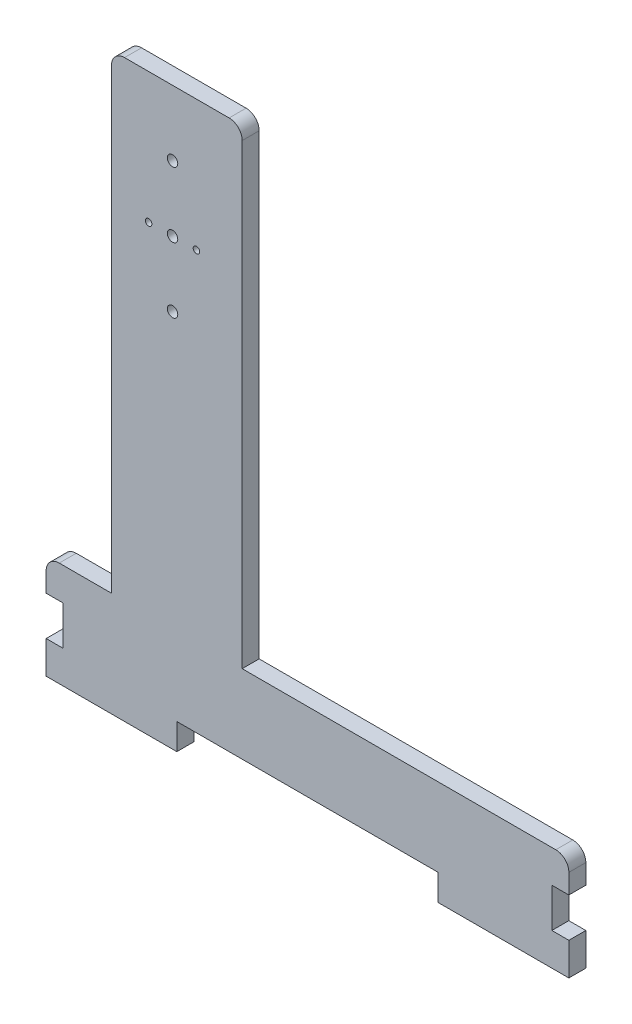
ISO-10303-21;
HEADER;
FILE_DESCRIPTION(('STEP AP214'),'2;1');
FILE_NAME('part.step','',(''),(''),'','','');
FILE_SCHEMA(('AUTOMOTIVE_DESIGN { 1 0 10303 214 1 1 1 1 }'));
ENDSEC;
DATA;
#1=APPLICATION_CONTEXT('core data for automotive mechanical design processes');
#2=APPLICATION_PROTOCOL_DEFINITION('international standard','automotive_design',2000,#1);
#3=PRODUCT_CONTEXT('',#1,'mechanical');
#4=PRODUCT('Part','Part','',(#3));
#5=PRODUCT_RELATED_PRODUCT_CATEGORY('part','',(#4));
#6=PRODUCT_DEFINITION_FORMATION('','',#4);
#7=PRODUCT_DEFINITION_CONTEXT('part definition',#1,'design');
#8=PRODUCT_DEFINITION('design','',#6,#7);
#9=PRODUCT_DEFINITION_SHAPE('','',#8);
#10=(LENGTH_UNIT() NAMED_UNIT(*) SI_UNIT(.MILLI.,.METRE.));
#11=(NAMED_UNIT(*) PLANE_ANGLE_UNIT() SI_UNIT($,.RADIAN.));
#12=(NAMED_UNIT(*) SI_UNIT($,.STERADIAN.) SOLID_ANGLE_UNIT());
#13=UNCERTAINTY_MEASURE_WITH_UNIT(LENGTH_MEASURE(1.E-05),#10,'distance_accuracy_value','');
#14=(GEOMETRIC_REPRESENTATION_CONTEXT(3) GLOBAL_UNCERTAINTY_ASSIGNED_CONTEXT((#13)) GLOBAL_UNIT_ASSIGNED_CONTEXT((#10,
#11,#12)) REPRESENTATION_CONTEXT('',''));
#15=CARTESIAN_POINT('',(0.,0.,0.));
#16=DIRECTION('',(0.,0.,1.));
#17=DIRECTION('',(1.,0.,0.));
#18=AXIS2_PLACEMENT_3D('',#15,#16,#17);
#19=CARTESIAN_POINT('',(-200.,-40.,13.));
#20=DIRECTION('',(1.,0.,0.));
#21=DIRECTION('',(0.,0.,-1.));
#22=AXIS2_PLACEMENT_3D('',#19,#20,#21);
#23=PLANE('',#22);
#24=DIRECTION('',(0.,-1.,0.));
#25=VECTOR('',#24,1.);
#26=CARTESIAN_POINT('',(-200.,-40.,0.));
#27=LINE('',#26,#25);
#28=CARTESIAN_POINT('',(-200.,30.,0.));
#29=VERTEX_POINT('',#28);
#30=CARTESIAN_POINT('',(-200.,15.,0.));
#31=VERTEX_POINT('',#30);
#32=EDGE_CURVE('E349',#29,#31,#27,.T.);
#33=ORIENTED_EDGE('',*,*,#32,.T.);
#34=DIRECTION('',(0.,0.,1.));
#35=VECTOR('',#34,1.);
#36=CARTESIAN_POINT('',(-200.,15.,0.));
#37=LINE('',#36,#35);
#38=CARTESIAN_POINT('',(-200.,15.,13.));
#39=VERTEX_POINT('',#38);
#40=EDGE_CURVE('E496',#31,#39,#37,.T.);
#41=ORIENTED_EDGE('',*,*,#40,.T.);
#42=DIRECTION('',(0.,-1.,0.));
#43=VECTOR('',#42,1.);
#44=CARTESIAN_POINT('',(-200.,-40.,13.));
#45=LINE('',#44,#43);
#46=CARTESIAN_POINT('',(-200.,30.,13.));
#47=VERTEX_POINT('',#46);
#48=EDGE_CURVE('E350',#47,#39,#45,.T.);
#49=ORIENTED_EDGE('',*,*,#48,.F.);
#50=DIRECTION('',(0.,0.,-1.));
#51=VECTOR('',#50,1.);
#52=CARTESIAN_POINT('',(-200.,30.,13.));
#53=LINE('',#52,#51);
#54=EDGE_CURVE('E314',#47,#29,#53,.T.);
#55=ORIENTED_EDGE('',*,*,#54,.T.);
#56=EDGE_LOOP('',(#33,#41,#49,#55));
#57=FACE_BOUND('',#56,.T.);
#58=ADVANCED_FACE('F43',(#57),#23,.F.);
#59=CARTESIAN_POINT('',(200.,-40.,13.));
#60=DIRECTION('',(-1.,0.,0.));
#61=DIRECTION('',(0.,0.,1.));
#62=AXIS2_PLACEMENT_3D('',#59,#60,#61);
#63=PLANE('',#62);
#64=DIRECTION('',(0.,1.,0.));
#65=VECTOR('',#64,1.);
#66=CARTESIAN_POINT('',(200.,-40.,0.));
#67=LINE('',#66,#65);
#68=CARTESIAN_POINT('',(200.,-40.,0.));
#69=VERTEX_POINT('',#68);
#70=CARTESIAN_POINT('',(200.,-15.,0.));
#71=VERTEX_POINT('',#70);
#72=EDGE_CURVE('E230',#69,#71,#67,.T.);
#73=ORIENTED_EDGE('',*,*,#72,.T.);
#74=DIRECTION('',(0.,0.,1.));
#75=VECTOR('',#74,1.);
#76=CARTESIAN_POINT('',(200.,-15.,0.));
#77=LINE('',#76,#75);
#78=CARTESIAN_POINT('',(200.,-15.,13.));
#79=VERTEX_POINT('',#78);
#80=EDGE_CURVE('E390',#71,#79,#77,.T.);
#81=ORIENTED_EDGE('',*,*,#80,.T.);
#82=DIRECTION('',(0.,1.,0.));
#83=VECTOR('',#82,1.);
#84=CARTESIAN_POINT('',(200.,-40.,13.));
#85=LINE('',#84,#83);
#86=CARTESIAN_POINT('',(200.,-40.,13.));
#87=VERTEX_POINT('',#86);
#88=EDGE_CURVE('E246',#87,#79,#85,.T.);
#89=ORIENTED_EDGE('',*,*,#88,.F.);
#90=DIRECTION('',(0.,0.,-1.));
#91=VECTOR('',#90,1.);
#92=CARTESIAN_POINT('',(200.,-40.,13.));
#93=LINE('',#92,#91);
#94=EDGE_CURVE('E241',#87,#69,#93,.T.);
#95=ORIENTED_EDGE('',*,*,#94,.T.);
#96=EDGE_LOOP('',(#73,#81,#89,#95));
#97=FACE_BOUND('',#96,.T.);
#98=ADVANCED_FACE('F388',(#97),#63,.F.);
#99=CARTESIAN_POINT('',(-50.0000000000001,40.,13.));
#100=DIRECTION('',(0.,-1.,0.));
#101=DIRECTION('',(0.,0.,-1.));
#102=AXIS2_PLACEMENT_3D('',#99,#100,#101);
#103=PLANE('',#102);
#104=DIRECTION('',(-1.,0.,0.));
#105=VECTOR('',#104,1.);
#106=CARTESIAN_POINT('',(-50.0000000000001,40.,13.));
#107=LINE('',#106,#105);
#108=CARTESIAN_POINT('',(190.,40.,13.));
#109=VERTEX_POINT('',#108);
#110=CARTESIAN_POINT('',(-50.0000000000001,40.,13.));
#111=VERTEX_POINT('',#110);
#112=EDGE_CURVE('E236',#109,#111,#107,.T.);
#113=ORIENTED_EDGE('',*,*,#112,.F.);
#114=DIRECTION('',(0.,0.,-1.));
#115=VECTOR('',#114,1.);
#116=CARTESIAN_POINT('',(190.,40.,13.));
#117=LINE('',#116,#115);
#118=CARTESIAN_POINT('',(190.,40.,0.));
#119=VERTEX_POINT('',#118);
#120=EDGE_CURVE('E302',#109,#119,#117,.T.);
#121=ORIENTED_EDGE('',*,*,#120,.T.);
#122=DIRECTION('',(-1.,0.,0.));
#123=VECTOR('',#122,1.);
#124=CARTESIAN_POINT('',(-50.0000000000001,40.,0.));
#125=LINE('',#124,#123);
#126=CARTESIAN_POINT('',(-50.0000000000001,40.,0.));
#127=VERTEX_POINT('',#126);
#128=EDGE_CURVE('E398',#119,#127,#125,.T.);
#129=ORIENTED_EDGE('',*,*,#128,.T.);
#130=DIRECTION('',(0.,0.,-1.));
#131=VECTOR('',#130,1.);
#132=CARTESIAN_POINT('',(-50.0000000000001,40.,13.));
#133=LINE('',#132,#131);
#134=EDGE_CURVE('E270',#111,#127,#133,.T.);
#135=ORIENTED_EDGE('',*,*,#134,.F.);
#136=EDGE_LOOP('',(#113,#121,#129,#135));
#137=FACE_BOUND('',#136,.T.);
#138=ADVANCED_FACE('F437',(#137),#103,.F.);
#139=CARTESIAN_POINT('',(-50.0000000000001,40.,13.));
#140=DIRECTION('',(-1.,0.,0.));
#141=DIRECTION('',(0.,0.,1.));
#142=AXIS2_PLACEMENT_3D('',#139,#140,#141);
#143=PLANE('',#142);
#144=DIRECTION('',(0.,1.,0.));
#145=VECTOR('',#144,1.);
#146=CARTESIAN_POINT('',(-50.0000000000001,40.,0.));
#147=LINE('',#146,#145);
#148=CARTESIAN_POINT('',(-50.0000000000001,390.,0.));
#149=VERTEX_POINT('',#148);
#150=EDGE_CURVE('E401',#127,#149,#147,.T.);
#151=ORIENTED_EDGE('',*,*,#150,.T.);
#152=DIRECTION('',(0.,0.,-1.));
#153=VECTOR('',#152,1.);
#154=CARTESIAN_POINT('',(-50.0000000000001,390.,13.));
#155=LINE('',#154,#153);
#156=CARTESIAN_POINT('',(-50.0000000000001,390.,13.));
#157=VERTEX_POINT('',#156);
#158=EDGE_CURVE('E296',#149,#157,#155,.F.);
#159=ORIENTED_EDGE('',*,*,#158,.T.);
#160=DIRECTION('',(0.,1.,0.));
#161=VECTOR('',#160,1.);
#162=CARTESIAN_POINT('',(-50.0000000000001,40.,13.));
#163=LINE('',#162,#161);
#164=EDGE_CURVE('E434',#111,#157,#163,.T.);
#165=ORIENTED_EDGE('',*,*,#164,.F.);
#166=ORIENTED_EDGE('',*,*,#134,.T.);
#167=EDGE_LOOP('',(#151,#159,#165,#166));
#168=FACE_BOUND('',#167,.T.);
#169=ADVANCED_FACE('F430',(#168),#143,.F.);
#170=CARTESIAN_POINT('',(-150.,400.,13.));
#171=DIRECTION('',(0.,-1.,0.));
#172=DIRECTION('',(0.,0.,-1.));
#173=AXIS2_PLACEMENT_3D('',#170,#171,#172);
#174=PLANE('',#173);
#175=DIRECTION('',(-1.,0.,0.));
#176=VECTOR('',#175,1.);
#177=CARTESIAN_POINT('',(-150.,400.,13.));
#178=LINE('',#177,#176);
#179=CARTESIAN_POINT('',(-60.0000000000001,400.,13.));
#180=VERTEX_POINT('',#179);
#181=CARTESIAN_POINT('',(-140.,400.,13.));
#182=VERTEX_POINT('',#181);
#183=EDGE_CURVE('E422',#180,#182,#178,.T.);
#184=ORIENTED_EDGE('',*,*,#183,.F.);
#185=DIRECTION('',(0.,0.,-1.));
#186=VECTOR('',#185,1.);
#187=CARTESIAN_POINT('',(-60.0000000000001,400.,13.));
#188=LINE('',#187,#186);
#189=CARTESIAN_POINT('',(-60.0000000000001,400.,0.));
#190=VERTEX_POINT('',#189);
#191=EDGE_CURVE('E289',#180,#190,#188,.T.);
#192=ORIENTED_EDGE('',*,*,#191,.T.);
#193=DIRECTION('',(-1.,0.,0.));
#194=VECTOR('',#193,1.);
#195=CARTESIAN_POINT('',(-150.,400.,0.));
#196=LINE('',#195,#194);
#197=CARTESIAN_POINT('',(-140.,400.,0.));
#198=VERTEX_POINT('',#197);
#199=EDGE_CURVE('E405',#190,#198,#196,.T.);
#200=ORIENTED_EDGE('',*,*,#199,.T.);
#201=DIRECTION('',(0.,0.,-1.));
#202=VECTOR('',#201,1.);
#203=CARTESIAN_POINT('',(-140.,400.,13.));
#204=LINE('',#203,#202);
#205=EDGE_CURVE('E282',#198,#182,#204,.F.);
#206=ORIENTED_EDGE('',*,*,#205,.T.);
#207=EDGE_LOOP('',(#184,#192,#200,#206));
#208=FACE_BOUND('',#207,.T.);
#209=ADVANCED_FACE('F421',(#208),#174,.F.);
#210=CARTESIAN_POINT('',(-150.,40.,13.));
#211=DIRECTION('',(1.,0.,0.));
#212=DIRECTION('',(0.,0.,-1.));
#213=AXIS2_PLACEMENT_3D('',#210,#211,#212);
#214=PLANE('',#213);
#215=DIRECTION('',(0.,-1.,0.));
#216=VECTOR('',#215,1.);
#217=CARTESIAN_POINT('',(-150.,40.,13.));
#218=LINE('',#217,#216);
#219=CARTESIAN_POINT('',(-150.,390.,13.));
#220=VERTEX_POINT('',#219);
#221=CARTESIAN_POINT('',(-150.,40.,13.));
#222=VERTEX_POINT('',#221);
#223=EDGE_CURVE('E339',#220,#222,#218,.T.);
#224=ORIENTED_EDGE('',*,*,#223,.F.);
#225=DIRECTION('',(0.,0.,-1.));
#226=VECTOR('',#225,1.);
#227=CARTESIAN_POINT('',(-150.,390.,13.));
#228=LINE('',#227,#226);
#229=CARTESIAN_POINT('',(-150.,390.,0.));
#230=VERTEX_POINT('',#229);
#231=EDGE_CURVE('E274',#220,#230,#228,.T.);
#232=ORIENTED_EDGE('',*,*,#231,.T.);
#233=DIRECTION('',(0.,-1.,0.));
#234=VECTOR('',#233,1.);
#235=CARTESIAN_POINT('',(-150.,40.,0.));
#236=LINE('',#235,#234);
#237=CARTESIAN_POINT('',(-150.,40.,0.));
#238=VERTEX_POINT('',#237);
#239=EDGE_CURVE('E407',#230,#238,#236,.T.);
#240=ORIENTED_EDGE('',*,*,#239,.T.);
#241=DIRECTION('',(0.,0.,-1.));
#242=VECTOR('',#241,1.);
#243=CARTESIAN_POINT('',(-150.,40.,13.));
#244=LINE('',#243,#242);
#245=EDGE_CURVE('E266',#222,#238,#244,.T.);
#246=ORIENTED_EDGE('',*,*,#245,.F.);
#247=EDGE_LOOP('',(#224,#232,#240,#246));
#248=FACE_BOUND('',#247,.T.);
#249=ADVANCED_FACE('F412',(#248),#214,.F.);
#250=CARTESIAN_POINT('',(-200.,40.,13.));
#251=DIRECTION('',(0.,-1.,0.));
#252=DIRECTION('',(0.,0.,-1.));
#253=AXIS2_PLACEMENT_3D('',#250,#251,#252);
#254=PLANE('',#253);
#255=DIRECTION('',(-1.,0.,0.));
#256=VECTOR('',#255,1.);
#257=CARTESIAN_POINT('',(-200.,40.,0.));
#258=LINE('',#257,#256);
#259=CARTESIAN_POINT('',(-190.,40.,0.));
#260=VERTEX_POINT('',#259);
#261=EDGE_CURVE('E329',#238,#260,#258,.T.);
#262=ORIENTED_EDGE('',*,*,#261,.T.);
#263=DIRECTION('',(0.,0.,-1.));
#264=VECTOR('',#263,1.);
#265=CARTESIAN_POINT('',(-190.,40.,13.));
#266=LINE('',#265,#264);
#267=CARTESIAN_POINT('',(-190.,40.,13.));
#268=VERTEX_POINT('',#267);
#269=EDGE_CURVE('E52',#260,#268,#266,.F.);
#270=ORIENTED_EDGE('',*,*,#269,.T.);
#271=DIRECTION('',(-1.,0.,0.));
#272=VECTOR('',#271,1.);
#273=CARTESIAN_POINT('',(-200.,40.,13.));
#274=LINE('',#273,#272);
#275=EDGE_CURVE('E327',#222,#268,#274,.T.);
#276=ORIENTED_EDGE('',*,*,#275,.F.);
#277=ORIENTED_EDGE('',*,*,#245,.T.);
#278=EDGE_LOOP('',(#262,#270,#276,#277));
#279=FACE_BOUND('',#278,.T.);
#280=ADVANCED_FACE('F326',(#279),#254,.F.);
#281=CARTESIAN_POINT('',(-200.,-15.,13.));
#282=VERTEX_POINT('',#281);
#283=CARTESIAN_POINT('',(-200.,-40.,13.));
#284=VERTEX_POINT('',#283);
#285=EDGE_CURVE('E342',#282,#284,#45,.T.);
#286=ORIENTED_EDGE('',*,*,#285,.F.);
#287=DIRECTION('',(0.,0.,1.));
#288=VECTOR('',#287,1.);
#289=CARTESIAN_POINT('',(-200.,-15.,0.));
#290=LINE('',#289,#288);
#291=CARTESIAN_POINT('',(-200.,-15.,0.));
#292=VERTEX_POINT('',#291);
#293=EDGE_CURVE('E499',#292,#282,#290,.T.);
#294=ORIENTED_EDGE('',*,*,#293,.F.);
#295=CARTESIAN_POINT('',(-200.,-40.,0.));
#296=VERTEX_POINT('',#295);
#297=EDGE_CURVE('E356',#292,#296,#27,.T.);
#298=ORIENTED_EDGE('',*,*,#297,.T.);
#299=DIRECTION('',(0.,0.,-1.));
#300=VECTOR('',#299,1.);
#301=CARTESIAN_POINT('',(-200.,-40.,13.));
#302=LINE('',#301,#300);
#303=EDGE_CURVE('E262',#284,#296,#302,.T.);
#304=ORIENTED_EDGE('',*,*,#303,.F.);
#305=EDGE_LOOP('',(#286,#294,#298,#304));
#306=FACE_BOUND('',#305,.T.);
#307=ADVANCED_FACE('F571',(#306),#23,.F.);
#308=CARTESIAN_POINT('',(-200.,-40.,13.));
#309=DIRECTION('',(0.,1.,0.));
#310=DIRECTION('',(-1.,0.,0.));
#311=AXIS2_PLACEMENT_3D('',#308,#309,#310);
#312=PLANE('',#311);
#313=DIRECTION('',(1.,0.,0.));
#314=VECTOR('',#313,1.);
#315=CARTESIAN_POINT('',(-200.,-40.,0.));
#316=LINE('',#315,#314);
#317=CARTESIAN_POINT('',(-100.,-40.,0.));
#318=VERTEX_POINT('',#317);
#319=EDGE_CURVE('E355',#296,#318,#316,.T.);
#320=ORIENTED_EDGE('',*,*,#319,.T.);
#321=DIRECTION('',(0.,0.,-1.));
#322=VECTOR('',#321,1.);
#323=CARTESIAN_POINT('',(-100.,-40.,13.));
#324=LINE('',#323,#322);
#325=CARTESIAN_POINT('',(-100.,-40.,13.));
#326=VERTEX_POINT('',#325);
#327=EDGE_CURVE('E258',#326,#318,#324,.T.);
#328=ORIENTED_EDGE('',*,*,#327,.F.);
#329=DIRECTION('',(1.,0.,0.));
#330=VECTOR('',#329,1.);
#331=CARTESIAN_POINT('',(-200.,-40.,13.));
#332=LINE('',#331,#330);
#333=EDGE_CURVE('E543',#284,#326,#332,.T.);
#334=ORIENTED_EDGE('',*,*,#333,.F.);
#335=ORIENTED_EDGE('',*,*,#303,.T.);
#336=EDGE_LOOP('',(#320,#328,#334,#335));
#337=FACE_BOUND('',#336,.T.);
#338=ADVANCED_FACE('F567',(#337),#312,.F.);
#339=CARTESIAN_POINT('',(-100.,-40.,13.));
#340=DIRECTION('',(-1.,0.,0.));
#341=DIRECTION('',(0.,-1.,0.));
#342=AXIS2_PLACEMENT_3D('',#339,#340,#341);
#343=PLANE('',#342);
#344=DIRECTION('',(0.,1.,0.));
#345=VECTOR('',#344,1.);
#346=CARTESIAN_POINT('',(-100.,-40.,0.));
#347=LINE('',#346,#345);
#348=CARTESIAN_POINT('',(-100.,-20.,0.));
#349=VERTEX_POINT('',#348);
#350=EDGE_CURVE('E360',#318,#349,#347,.T.);
#351=ORIENTED_EDGE('',*,*,#350,.T.);
#352=DIRECTION('',(0.,0.,-1.));
#353=VECTOR('',#352,1.);
#354=CARTESIAN_POINT('',(-100.,-20.,13.));
#355=LINE('',#354,#353);
#356=CARTESIAN_POINT('',(-100.,-20.,13.));
#357=VERTEX_POINT('',#356);
#358=EDGE_CURVE('E254',#357,#349,#355,.T.);
#359=ORIENTED_EDGE('',*,*,#358,.F.);
#360=DIRECTION('',(0.,1.,0.));
#361=VECTOR('',#360,1.);
#362=CARTESIAN_POINT('',(-100.,-40.,13.));
#363=LINE('',#362,#361);
#364=EDGE_CURVE('E546',#326,#357,#363,.T.);
#365=ORIENTED_EDGE('',*,*,#364,.F.);
#366=ORIENTED_EDGE('',*,*,#327,.T.);
#367=EDGE_LOOP('',(#351,#359,#365,#366));
#368=FACE_BOUND('',#367,.T.);
#369=ADVANCED_FACE('F563',(#368),#343,.F.);
#370=CARTESIAN_POINT('',(-100.,-20.,13.));
#371=DIRECTION('',(0.,1.,0.));
#372=DIRECTION('',(0.,0.,1.));
#373=AXIS2_PLACEMENT_3D('',#370,#371,#372);
#374=PLANE('',#373);
#375=DIRECTION('',(1.,0.,0.));
#376=VECTOR('',#375,1.);
#377=CARTESIAN_POINT('',(-100.,-20.,0.));
#378=LINE('',#377,#376);
#379=CARTESIAN_POINT('',(99.9999999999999,-20.,0.));
#380=VERTEX_POINT('',#379);
#381=EDGE_CURVE('E367',#349,#380,#378,.T.);
#382=ORIENTED_EDGE('',*,*,#381,.T.);
#383=DIRECTION('',(0.,0.,-1.));
#384=VECTOR('',#383,1.);
#385=CARTESIAN_POINT('',(99.9999999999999,-20.,13.));
#386=LINE('',#385,#384);
#387=CARTESIAN_POINT('',(99.9999999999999,-20.,13.));
#388=VERTEX_POINT('',#387);
#389=EDGE_CURVE('E250',#388,#380,#386,.T.);
#390=ORIENTED_EDGE('',*,*,#389,.F.);
#391=DIRECTION('',(1.,0.,0.));
#392=VECTOR('',#391,1.);
#393=CARTESIAN_POINT('',(-100.,-20.,13.));
#394=LINE('',#393,#392);
#395=EDGE_CURVE('E549',#357,#388,#394,.T.);
#396=ORIENTED_EDGE('',*,*,#395,.F.);
#397=ORIENTED_EDGE('',*,*,#358,.T.);
#398=EDGE_LOOP('',(#382,#390,#396,#397));
#399=FACE_BOUND('',#398,.T.);
#400=ADVANCED_FACE('F558',(#399),#374,.F.);
#401=CARTESIAN_POINT('',(100.,-40.,13.));
#402=DIRECTION('',(1.,0.,0.));
#403=DIRECTION('',(0.,1.,0.));
#404=AXIS2_PLACEMENT_3D('',#401,#402,#403);
#405=PLANE('',#404);
#406=DIRECTION('',(0.,-1.,0.));
#407=VECTOR('',#406,1.);
#408=CARTESIAN_POINT('',(100.,-40.,0.));
#409=LINE('',#408,#407);
#410=CARTESIAN_POINT('',(100.,-40.,0.));
#411=VERTEX_POINT('',#410);
#412=EDGE_CURVE('E237',#380,#411,#409,.T.);
#413=ORIENTED_EDGE('',*,*,#412,.T.);
#414=DIRECTION('',(0.,0.,-1.));
#415=VECTOR('',#414,1.);
#416=CARTESIAN_POINT('',(100.,-40.,13.));
#417=LINE('',#416,#415);
#418=CARTESIAN_POINT('',(100.,-40.,13.));
#419=VERTEX_POINT('',#418);
#420=EDGE_CURVE('E245',#419,#411,#417,.T.);
#421=ORIENTED_EDGE('',*,*,#420,.F.);
#422=DIRECTION('',(0.,-1.,0.));
#423=VECTOR('',#422,1.);
#424=CARTESIAN_POINT('',(100.,-40.,13.));
#425=LINE('',#424,#423);
#426=EDGE_CURVE('E551',#388,#419,#425,.T.);
#427=ORIENTED_EDGE('',*,*,#426,.F.);
#428=ORIENTED_EDGE('',*,*,#389,.T.);
#429=EDGE_LOOP('',(#413,#421,#427,#428));
#430=FACE_BOUND('',#429,.T.);
#431=ADVANCED_FACE('F373',(#430),#405,.F.);
#432=CARTESIAN_POINT('',(100.,-40.,13.));
#433=DIRECTION('',(0.,1.,0.));
#434=DIRECTION('',(-1.,0.,0.));
#435=AXIS2_PLACEMENT_3D('',#432,#433,#434);
#436=PLANE('',#435);
#437=DIRECTION('',(1.,0.,0.));
#438=VECTOR('',#437,1.);
#439=CARTESIAN_POINT('',(100.,-40.,0.));
#440=LINE('',#439,#438);
#441=EDGE_CURVE('E231',#411,#69,#440,.T.);
#442=ORIENTED_EDGE('',*,*,#441,.T.);
#443=ORIENTED_EDGE('',*,*,#94,.F.);
#444=DIRECTION('',(1.,0.,0.));
#445=VECTOR('',#444,1.);
#446=CARTESIAN_POINT('',(100.,-40.,13.));
#447=LINE('',#446,#445);
#448=EDGE_CURVE('E382',#419,#87,#447,.T.);
#449=ORIENTED_EDGE('',*,*,#448,.F.);
#450=ORIENTED_EDGE('',*,*,#420,.T.);
#451=EDGE_LOOP('',(#442,#443,#449,#450));
#452=FACE_BOUND('',#451,.T.);
#453=ADVANCED_FACE('F380',(#452),#436,.F.);
#454=CARTESIAN_POINT('',(200.,15.,13.));
#455=VERTEX_POINT('',#454);
#456=CARTESIAN_POINT('',(200.,30.,13.));
#457=VERTEX_POINT('',#456);
#458=EDGE_CURVE('E221',#455,#457,#85,.T.);
#459=ORIENTED_EDGE('',*,*,#458,.F.);
#460=DIRECTION('',(0.,0.,1.));
#461=VECTOR('',#460,1.);
#462=CARTESIAN_POINT('',(200.,15.,0.));
#463=LINE('',#462,#461);
#464=CARTESIAN_POINT('',(200.,15.,0.));
#465=VERTEX_POINT('',#464);
#466=EDGE_CURVE('E207',#465,#455,#463,.T.);
#467=ORIENTED_EDGE('',*,*,#466,.F.);
#468=CARTESIAN_POINT('',(200.,30.,0.));
#469=VERTEX_POINT('',#468);
#470=EDGE_CURVE('E219',#465,#469,#67,.T.);
#471=ORIENTED_EDGE('',*,*,#470,.T.);
#472=DIRECTION('',(0.,0.,-1.));
#473=VECTOR('',#472,1.);
#474=CARTESIAN_POINT('',(200.,30.,13.));
#475=LINE('',#474,#473);
#476=EDGE_CURVE('E308',#469,#457,#475,.F.);
#477=ORIENTED_EDGE('',*,*,#476,.T.);
#478=EDGE_LOOP('',(#459,#467,#471,#477));
#479=FACE_BOUND('',#478,.T.);
#480=ADVANCED_FACE('F217',(#479),#63,.F.);
#481=CARTESIAN_POINT('',(0.,0.,13.));
#482=DIRECTION('',(0.,0.,1.));
#483=DIRECTION('',(1.,0.,0.));
#484=AXIS2_PLACEMENT_3D('',#481,#482,#483);
#485=PLANE('',#484);
#486=DIRECTION('',(1.,0.,0.));
#487=VECTOR('',#486,1.);
#488=CARTESIAN_POINT('',(200.,-15.,13.));
#489=LINE('',#488,#487);
#490=CARTESIAN_POINT('',(187.,-15.,13.));
#491=VERTEX_POINT('',#490);
#492=EDGE_CURVE('E213',#491,#79,#489,.T.);
#493=ORIENTED_EDGE('',*,*,#492,.F.);
#494=DIRECTION('',(0.,-1.,0.));
#495=VECTOR('',#494,1.);
#496=CARTESIAN_POINT('',(187.,15.,13.));
#497=LINE('',#496,#495);
#498=CARTESIAN_POINT('',(187.,15.,13.));
#499=VERTEX_POINT('',#498);
#500=EDGE_CURVE('E445',#499,#491,#497,.T.);
#501=ORIENTED_EDGE('',*,*,#500,.F.);
#502=DIRECTION('',(-1.,0.,0.));
#503=VECTOR('',#502,1.);
#504=CARTESIAN_POINT('',(200.,15.,13.));
#505=LINE('',#504,#503);
#506=EDGE_CURVE('E443',#455,#499,#505,.T.);
#507=ORIENTED_EDGE('',*,*,#506,.F.);
#508=ORIENTED_EDGE('',*,*,#458,.T.);
#509=CARTESIAN_POINT('',(190.,30.,13.));
#510=DIRECTION('',(0.,0.,1.));
#511=DIRECTION('',(1.,0.,0.));
#512=AXIS2_PLACEMENT_3D('',#509,#510,#511);
#513=CIRCLE('',#512,10.);
#514=EDGE_CURVE('E311',#457,#109,#513,.T.);
#515=ORIENTED_EDGE('',*,*,#514,.T.);
#516=ORIENTED_EDGE('',*,*,#112,.T.);
#517=ORIENTED_EDGE('',*,*,#164,.T.);
#518=CARTESIAN_POINT('',(-60.0000000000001,390.,13.));
#519=DIRECTION('',(0.,0.,1.));
#520=DIRECTION('',(1.,0.,0.));
#521=AXIS2_PLACEMENT_3D('',#518,#519,#520);
#522=CIRCLE('',#521,10.);
#523=EDGE_CURVE('E299',#157,#180,#522,.T.);
#524=ORIENTED_EDGE('',*,*,#523,.T.);
#525=ORIENTED_EDGE('',*,*,#183,.T.);
#526=CARTESIAN_POINT('',(-140.,390.,13.));
#527=DIRECTION('',(0.,0.,1.));
#528=DIRECTION('',(1.,0.,0.));
#529=AXIS2_PLACEMENT_3D('',#526,#527,#528);
#530=CIRCLE('',#529,10.);
#531=EDGE_CURVE('E286',#182,#220,#530,.T.);
#532=ORIENTED_EDGE('',*,*,#531,.T.);
#533=ORIENTED_EDGE('',*,*,#223,.T.);
#534=ORIENTED_EDGE('',*,*,#275,.T.);
#535=CARTESIAN_POINT('',(-190.,30.,13.));
#536=DIRECTION('',(0.,0.,1.));
#537=DIRECTION('',(1.,0.,0.));
#538=AXIS2_PLACEMENT_3D('',#535,#536,#537);
#539=CIRCLE('',#538,10.);
#540=EDGE_CURVE('E11',#268,#47,#539,.T.);
#541=ORIENTED_EDGE('',*,*,#540,.T.);
#542=ORIENTED_EDGE('',*,*,#48,.T.);
#543=DIRECTION('',(-1.,0.,0.));
#544=VECTOR('',#543,1.);
#545=CARTESIAN_POINT('',(-200.,15.,13.));
#546=LINE('',#545,#544);
#547=CARTESIAN_POINT('',(-187.,15.,13.));
#548=VERTEX_POINT('',#547);
#549=EDGE_CURVE('E495',#548,#39,#546,.T.);
#550=ORIENTED_EDGE('',*,*,#549,.F.);
#551=DIRECTION('',(0.,1.,0.));
#552=VECTOR('',#551,1.);
#553=CARTESIAN_POINT('',(-187.,15.,13.));
#554=LINE('',#553,#552);
#555=CARTESIAN_POINT('',(-187.,-15.,13.));
#556=VERTEX_POINT('',#555);
#557=EDGE_CURVE('E509',#556,#548,#554,.T.);
#558=ORIENTED_EDGE('',*,*,#557,.F.);
#559=DIRECTION('',(1.,0.,0.));
#560=VECTOR('',#559,1.);
#561=CARTESIAN_POINT('',(-200.,-15.,13.));
#562=LINE('',#561,#560);
#563=EDGE_CURVE('E513',#282,#556,#562,.T.);
#564=ORIENTED_EDGE('',*,*,#563,.F.);
#565=ORIENTED_EDGE('',*,*,#285,.T.);
#566=ORIENTED_EDGE('',*,*,#333,.T.);
#567=ORIENTED_EDGE('',*,*,#364,.T.);
#568=ORIENTED_EDGE('',*,*,#395,.T.);
#569=ORIENTED_EDGE('',*,*,#426,.T.);
#570=ORIENTED_EDGE('',*,*,#448,.T.);
#571=ORIENTED_EDGE('',*,*,#88,.T.);
#572=EDGE_LOOP('',(#493,#501,#507,#508,#515,#516,#517,#524,#525,#532,#533,#534,#541,#542,#550,
#558,#564,#565,#566,#567,#568,#569,#570,#571));
#573=FACE_BOUND('',#572,.T.);
#574=CARTESIAN_POINT('',(-121.586771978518,300.,13.));
#575=DIRECTION('',(0.,0.,1.));
#576=DIRECTION('',(1.,0.,0.));
#577=AXIS2_PLACEMENT_3D('',#574,#575,#576);
#578=CIRCLE('',#577,2.50000000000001);
#579=CARTESIAN_POINT('',(-119.086771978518,300.,13.));
#580=VERTEX_POINT('',#579);
#581=EDGE_CURVE('E484',#580,#580,#578,.T.);
#582=ORIENTED_EDGE('',*,*,#581,.F.);
#583=EDGE_LOOP('',(#582));
#584=FACE_BOUND('',#583,.T.);
#585=CARTESIAN_POINT('',(-84.9867719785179,300.,13.));
#586=DIRECTION('',(0.,0.,1.));
#587=DIRECTION('',(1.,0.,0.));
#588=AXIS2_PLACEMENT_3D('',#585,#586,#587);
#589=CIRCLE('',#588,2.50000000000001);
#590=CARTESIAN_POINT('',(-82.4867719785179,300.,13.));
#591=VERTEX_POINT('',#590);
#592=EDGE_CURVE('E476',#591,#591,#589,.T.);
#593=ORIENTED_EDGE('',*,*,#592,.F.);
#594=EDGE_LOOP('',(#593));
#595=FACE_BOUND('',#594,.T.);
#596=CARTESIAN_POINT('',(-103.286771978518,300.,13.));
#597=DIRECTION('',(0.,0.,1.));
#598=DIRECTION('',(1.,0.,0.));
#599=AXIS2_PLACEMENT_3D('',#596,#597,#598);
#600=CIRCLE('',#599,4.00000000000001);
#601=CARTESIAN_POINT('',(-99.2867719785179,300.,13.));
#602=VERTEX_POINT('',#601);
#603=EDGE_CURVE('E467',#602,#602,#600,.T.);
#604=ORIENTED_EDGE('',*,*,#603,.F.);
#605=EDGE_LOOP('',(#604));
#606=FACE_BOUND('',#605,.T.);
#607=CARTESIAN_POINT('',(-103.286771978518,350.,13.));
#608=DIRECTION('',(0.,0.,1.));
#609=DIRECTION('',(1.,0.,0.));
#610=AXIS2_PLACEMENT_3D('',#607,#608,#609);
#611=CIRCLE('',#610,4.00000000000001);
#612=CARTESIAN_POINT('',(-99.2867719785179,350.,13.));
#613=VERTEX_POINT('',#612);
#614=EDGE_CURVE('E447',#613,#613,#611,.T.);
#615=ORIENTED_EDGE('',*,*,#614,.F.);
#616=EDGE_LOOP('',(#615));
#617=FACE_BOUND('',#616,.T.);
#618=CARTESIAN_POINT('',(-103.286771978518,250.,13.));
#619=DIRECTION('',(0.,0.,1.));
#620=DIRECTION('',(1.,0.,0.));
#621=AXIS2_PLACEMENT_3D('',#618,#619,#620);
#622=CIRCLE('',#621,4.00000000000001);
#623=CARTESIAN_POINT('',(-99.2867719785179,250.,13.));
#624=VERTEX_POINT('',#623);
#625=EDGE_CURVE('E508',#624,#624,#622,.T.);
#626=ORIENTED_EDGE('',*,*,#625,.F.);
#627=EDGE_LOOP('',(#626));
#628=FACE_BOUND('',#627,.T.);
#629=ADVANCED_FACE('F334',(#573,#584,#595,#606,#617,#628),#485,.T.);
#630=CARTESIAN_POINT('',(0.,0.,0.));
#631=DIRECTION('',(0.,0.,1.));
#632=DIRECTION('',(1.,0.,0.));
#633=AXIS2_PLACEMENT_3D('',#630,#631,#632);
#634=PLANE('',#633);
#635=CARTESIAN_POINT('',(-121.586771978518,300.,0.));
#636=DIRECTION('',(0.,0.,1.));
#637=DIRECTION('',(1.,0.,0.));
#638=AXIS2_PLACEMENT_3D('',#635,#636,#637);
#639=CIRCLE('',#638,2.50000000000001);
#640=CARTESIAN_POINT('',(-119.086771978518,300.,0.));
#641=VERTEX_POINT('',#640);
#642=EDGE_CURVE('E488',#641,#641,#639,.T.);
#643=ORIENTED_EDGE('',*,*,#642,.T.);
#644=EDGE_LOOP('',(#643));
#645=FACE_BOUND('',#644,.T.);
#646=CARTESIAN_POINT('',(-84.9867719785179,300.,0.));
#647=DIRECTION('',(0.,0.,1.));
#648=DIRECTION('',(1.,0.,0.));
#649=AXIS2_PLACEMENT_3D('',#646,#647,#648);
#650=CIRCLE('',#649,2.50000000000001);
#651=CARTESIAN_POINT('',(-82.4867719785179,300.,0.));
#652=VERTEX_POINT('',#651);
#653=EDGE_CURVE('E480',#652,#652,#650,.T.);
#654=ORIENTED_EDGE('',*,*,#653,.T.);
#655=EDGE_LOOP('',(#654));
#656=FACE_BOUND('',#655,.T.);
#657=CARTESIAN_POINT('',(-103.286771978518,300.,0.));
#658=DIRECTION('',(0.,0.,1.));
#659=DIRECTION('',(1.,0.,0.));
#660=AXIS2_PLACEMENT_3D('',#657,#658,#659);
#661=CIRCLE('',#660,4.00000000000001);
#662=CARTESIAN_POINT('',(-99.2867719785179,300.,0.));
#663=VERTEX_POINT('',#662);
#664=EDGE_CURVE('E472',#663,#663,#661,.T.);
#665=ORIENTED_EDGE('',*,*,#664,.T.);
#666=EDGE_LOOP('',(#665));
#667=FACE_BOUND('',#666,.T.);
#668=CARTESIAN_POINT('',(-103.286771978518,350.,0.));
#669=DIRECTION('',(0.,0.,1.));
#670=DIRECTION('',(1.,0.,0.));
#671=AXIS2_PLACEMENT_3D('',#668,#669,#670);
#672=CIRCLE('',#671,4.00000000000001);
#673=CARTESIAN_POINT('',(-99.2867719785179,350.,0.));
#674=VERTEX_POINT('',#673);
#675=EDGE_CURVE('E453',#674,#674,#672,.T.);
#676=ORIENTED_EDGE('',*,*,#675,.T.);
#677=EDGE_LOOP('',(#676));
#678=FACE_BOUND('',#677,.T.);
#679=CARTESIAN_POINT('',(-103.286771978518,250.,0.));
#680=DIRECTION('',(0.,0.,1.));
#681=DIRECTION('',(1.,0.,0.));
#682=AXIS2_PLACEMENT_3D('',#679,#680,#681);
#683=CIRCLE('',#682,4.00000000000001);
#684=CARTESIAN_POINT('',(-99.2867719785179,250.,0.));
#685=VERTEX_POINT('',#684);
#686=EDGE_CURVE('E471',#685,#685,#683,.T.);
#687=ORIENTED_EDGE('',*,*,#686,.T.);
#688=EDGE_LOOP('',(#687));
#689=FACE_BOUND('',#688,.T.);
#690=DIRECTION('',(0.,-1.,0.));
#691=VECTOR('',#690,1.);
#692=CARTESIAN_POINT('',(187.,15.,0.));
#693=LINE('',#692,#691);
#694=CARTESIAN_POINT('',(187.,15.,0.));
#695=VERTEX_POINT('',#694);
#696=CARTESIAN_POINT('',(187.,-15.,0.));
#697=VERTEX_POINT('',#696);
#698=EDGE_CURVE('E59',#695,#697,#693,.T.);
#699=ORIENTED_EDGE('',*,*,#698,.T.);
#700=DIRECTION('',(1.,0.,0.));
#701=VECTOR('',#700,1.);
#702=CARTESIAN_POINT('',(200.,-15.,0.));
#703=LINE('',#702,#701);
#704=EDGE_CURVE('E223',#697,#71,#703,.T.);
#705=ORIENTED_EDGE('',*,*,#704,.T.);
#706=ORIENTED_EDGE('',*,*,#72,.F.);
#707=ORIENTED_EDGE('',*,*,#441,.F.);
#708=ORIENTED_EDGE('',*,*,#412,.F.);
#709=ORIENTED_EDGE('',*,*,#381,.F.);
#710=ORIENTED_EDGE('',*,*,#350,.F.);
#711=ORIENTED_EDGE('',*,*,#319,.F.);
#712=ORIENTED_EDGE('',*,*,#297,.F.);
#713=DIRECTION('',(1.,0.,0.));
#714=VECTOR('',#713,1.);
#715=CARTESIAN_POINT('',(-200.,-15.,0.));
#716=LINE('',#715,#714);
#717=CARTESIAN_POINT('',(-187.,-15.,0.));
#718=VERTEX_POINT('',#717);
#719=EDGE_CURVE('E521',#292,#718,#716,.T.);
#720=ORIENTED_EDGE('',*,*,#719,.T.);
#721=DIRECTION('',(0.,1.,0.));
#722=VECTOR('',#721,1.);
#723=CARTESIAN_POINT('',(-187.,15.,0.));
#724=LINE('',#723,#722);
#725=CARTESIAN_POINT('',(-187.,15.,0.));
#726=VERTEX_POINT('',#725);
#727=EDGE_CURVE('E67',#718,#726,#724,.T.);
#728=ORIENTED_EDGE('',*,*,#727,.T.);
#729=DIRECTION('',(-1.,0.,0.));
#730=VECTOR('',#729,1.);
#731=CARTESIAN_POINT('',(-200.,15.,0.));
#732=LINE('',#731,#730);
#733=EDGE_CURVE('E353',#726,#31,#732,.T.);
#734=ORIENTED_EDGE('',*,*,#733,.T.);
#735=ORIENTED_EDGE('',*,*,#32,.F.);
#736=CARTESIAN_POINT('',(-190.,30.,0.));
#737=DIRECTION('',(0.,0.,1.));
#738=DIRECTION('',(1.,0.,0.));
#739=AXIS2_PLACEMENT_3D('',#736,#737,#738);
#740=CIRCLE('',#739,10.);
#741=EDGE_CURVE('E318',#29,#260,#740,.F.);
#742=ORIENTED_EDGE('',*,*,#741,.T.);
#743=ORIENTED_EDGE('',*,*,#261,.F.);
#744=ORIENTED_EDGE('',*,*,#239,.F.);
#745=CARTESIAN_POINT('',(-140.,390.,0.));
#746=DIRECTION('',(0.,0.,1.));
#747=DIRECTION('',(1.,0.,0.));
#748=AXIS2_PLACEMENT_3D('',#745,#746,#747);
#749=CIRCLE('',#748,10.);
#750=EDGE_CURVE('E278',#230,#198,#749,.F.);
#751=ORIENTED_EDGE('',*,*,#750,.T.);
#752=ORIENTED_EDGE('',*,*,#199,.F.);
#753=CARTESIAN_POINT('',(-60.0000000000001,390.,0.));
#754=DIRECTION('',(0.,0.,1.));
#755=DIRECTION('',(1.,0.,0.));
#756=AXIS2_PLACEMENT_3D('',#753,#754,#755);
#757=CIRCLE('',#756,10.);
#758=EDGE_CURVE('E293',#190,#149,#757,.F.);
#759=ORIENTED_EDGE('',*,*,#758,.T.);
#760=ORIENTED_EDGE('',*,*,#150,.F.);
#761=ORIENTED_EDGE('',*,*,#128,.F.);
#762=CARTESIAN_POINT('',(190.,30.,0.));
#763=DIRECTION('',(0.,0.,1.));
#764=DIRECTION('',(1.,0.,0.));
#765=AXIS2_PLACEMENT_3D('',#762,#763,#764);
#766=CIRCLE('',#765,10.);
#767=EDGE_CURVE('E227',#119,#469,#766,.F.);
#768=ORIENTED_EDGE('',*,*,#767,.T.);
#769=ORIENTED_EDGE('',*,*,#470,.F.);
#770=DIRECTION('',(-1.,0.,0.));
#771=VECTOR('',#770,1.);
#772=CARTESIAN_POINT('',(200.,15.,0.));
#773=LINE('',#772,#771);
#774=EDGE_CURVE('E203',#465,#695,#773,.T.);
#775=ORIENTED_EDGE('',*,*,#774,.T.);
#776=EDGE_LOOP('',(#699,#705,#706,#707,#708,#709,#710,#711,#712,#720,#728,#734,#735,#742,#743,
#744,#751,#752,#759,#760,#761,#768,#769,#775));
#777=FACE_BOUND('',#776,.T.);
#778=ADVANCED_FACE('F225',(#645,#656,#667,#678,#689,#777),#634,.F.);
#779=CARTESIAN_POINT('',(-140.,390.,13.));
#780=DIRECTION('',(0.,0.,-1.));
#781=DIRECTION('',(-1.,0.,0.));
#782=AXIS2_PLACEMENT_3D('',#779,#780,#781);
#783=CYLINDRICAL_SURFACE('',#782,10.);
#784=ORIENTED_EDGE('',*,*,#531,.F.);
#785=ORIENTED_EDGE('',*,*,#205,.F.);
#786=ORIENTED_EDGE('',*,*,#750,.F.);
#787=ORIENTED_EDGE('',*,*,#231,.F.);
#788=EDGE_LOOP('',(#784,#785,#786,#787));
#789=FACE_BOUND('',#788,.T.);
#790=ADVANCED_FACE('F418',(#789),#783,.T.);
#791=CARTESIAN_POINT('',(-60.0000000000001,390.,13.));
#792=DIRECTION('',(0.,0.,-1.));
#793=DIRECTION('',(-1.,0.,0.));
#794=AXIS2_PLACEMENT_3D('',#791,#792,#793);
#795=CYLINDRICAL_SURFACE('',#794,10.);
#796=ORIENTED_EDGE('',*,*,#523,.F.);
#797=ORIENTED_EDGE('',*,*,#158,.F.);
#798=ORIENTED_EDGE('',*,*,#758,.F.);
#799=ORIENTED_EDGE('',*,*,#191,.F.);
#800=EDGE_LOOP('',(#796,#797,#798,#799));
#801=FACE_BOUND('',#800,.T.);
#802=ADVANCED_FACE('F426',(#801),#795,.T.);
#803=CARTESIAN_POINT('',(190.,30.,13.));
#804=DIRECTION('',(0.,0.,-1.));
#805=DIRECTION('',(-1.,0.,0.));
#806=AXIS2_PLACEMENT_3D('',#803,#804,#805);
#807=CYLINDRICAL_SURFACE('',#806,10.);
#808=ORIENTED_EDGE('',*,*,#514,.F.);
#809=ORIENTED_EDGE('',*,*,#476,.F.);
#810=ORIENTED_EDGE('',*,*,#767,.F.);
#811=ORIENTED_EDGE('',*,*,#120,.F.);
#812=EDGE_LOOP('',(#808,#809,#810,#811));
#813=FACE_BOUND('',#812,.T.);
#814=ADVANCED_FACE('F441',(#813),#807,.T.);
#815=CARTESIAN_POINT('',(-190.,30.,13.));
#816=DIRECTION('',(0.,0.,-1.));
#817=DIRECTION('',(-1.,0.,0.));
#818=AXIS2_PLACEMENT_3D('',#815,#816,#817);
#819=CYLINDRICAL_SURFACE('',#818,10.);
#820=ORIENTED_EDGE('',*,*,#540,.F.);
#821=ORIENTED_EDGE('',*,*,#269,.F.);
#822=ORIENTED_EDGE('',*,*,#741,.F.);
#823=ORIENTED_EDGE('',*,*,#54,.F.);
#824=EDGE_LOOP('',(#820,#821,#822,#823));
#825=FACE_BOUND('',#824,.T.);
#826=ADVANCED_FACE('F45',(#825),#819,.T.);
#827=CARTESIAN_POINT('',(-103.286771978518,250.,0.));
#828=DIRECTION('',(0.,0.,1.));
#829=DIRECTION('',(1.,0.,0.));
#830=AXIS2_PLACEMENT_3D('',#827,#828,#829);
#831=CYLINDRICAL_SURFACE('',#830,4.00000000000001);
#832=ORIENTED_EDGE('',*,*,#686,.F.);
#833=EDGE_LOOP('',(#832));
#834=FACE_BOUND('',#833,.T.);
#835=ORIENTED_EDGE('',*,*,#625,.T.);
#836=EDGE_LOOP('',(#835));
#837=FACE_BOUND('',#836,.T.);
#838=ADVANCED_FACE('F582',(#834,#837),#831,.F.);
#839=CARTESIAN_POINT('',(-200.,15.,0.));
#840=DIRECTION('',(0.,1.,0.));
#841=DIRECTION('',(-1.,0.,0.));
#842=AXIS2_PLACEMENT_3D('',#839,#840,#841);
#843=PLANE('',#842);
#844=ORIENTED_EDGE('',*,*,#549,.T.);
#845=ORIENTED_EDGE('',*,*,#40,.F.);
#846=ORIENTED_EDGE('',*,*,#733,.F.);
#847=DIRECTION('',(0.,0.,1.));
#848=VECTOR('',#847,1.);
#849=CARTESIAN_POINT('',(-187.,15.,0.));
#850=LINE('',#849,#848);
#851=EDGE_CURVE('E505',#726,#548,#850,.T.);
#852=ORIENTED_EDGE('',*,*,#851,.T.);
#853=EDGE_LOOP('',(#844,#845,#846,#852));
#854=FACE_BOUND('',#853,.T.);
#855=ADVANCED_FACE('F580',(#854),#843,.F.);
#856=CARTESIAN_POINT('',(-187.,15.,0.));
#857=DIRECTION('',(1.,0.,0.));
#858=DIRECTION('',(0.,0.,-1.));
#859=AXIS2_PLACEMENT_3D('',#856,#857,#858);
#860=PLANE('',#859);
#861=ORIENTED_EDGE('',*,*,#557,.T.);
#862=ORIENTED_EDGE('',*,*,#851,.F.);
#863=ORIENTED_EDGE('',*,*,#727,.F.);
#864=DIRECTION('',(0.,0.,1.));
#865=VECTOR('',#864,1.);
#866=CARTESIAN_POINT('',(-187.,-15.,0.));
#867=LINE('',#866,#865);
#868=EDGE_CURVE('E502',#718,#556,#867,.T.);
#869=ORIENTED_EDGE('',*,*,#868,.T.);
#870=EDGE_LOOP('',(#861,#862,#863,#869));
#871=FACE_BOUND('',#870,.T.);
#872=ADVANCED_FACE('F577',(#871),#860,.F.);
#873=CARTESIAN_POINT('',(-200.,-15.,0.));
#874=DIRECTION('',(0.,-1.,0.));
#875=DIRECTION('',(1.,0.,0.));
#876=AXIS2_PLACEMENT_3D('',#873,#874,#875);
#877=PLANE('',#876);
#878=ORIENTED_EDGE('',*,*,#563,.T.);
#879=ORIENTED_EDGE('',*,*,#868,.F.);
#880=ORIENTED_EDGE('',*,*,#719,.F.);
#881=ORIENTED_EDGE('',*,*,#293,.T.);
#882=EDGE_LOOP('',(#878,#879,#880,#881));
#883=FACE_BOUND('',#882,.T.);
#884=ADVANCED_FACE('F574',(#883),#877,.F.);
#885=CARTESIAN_POINT('',(-103.286771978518,350.,0.));
#886=DIRECTION('',(0.,0.,1.));
#887=DIRECTION('',(1.,0.,0.));
#888=AXIS2_PLACEMENT_3D('',#885,#886,#887);
#889=CYLINDRICAL_SURFACE('',#888,4.00000000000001);
#890=ORIENTED_EDGE('',*,*,#675,.F.);
#891=EDGE_LOOP('',(#890));
#892=FACE_BOUND('',#891,.T.);
#893=ORIENTED_EDGE('',*,*,#614,.T.);
#894=EDGE_LOOP('',(#893));
#895=FACE_BOUND('',#894,.T.);
#896=ADVANCED_FACE('F658',(#892,#895),#889,.F.);
#897=CARTESIAN_POINT('',(-103.286771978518,300.,0.));
#898=DIRECTION('',(0.,0.,1.));
#899=DIRECTION('',(1.,0.,0.));
#900=AXIS2_PLACEMENT_3D('',#897,#898,#899);
#901=CYLINDRICAL_SURFACE('',#900,4.00000000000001);
#902=ORIENTED_EDGE('',*,*,#664,.F.);
#903=EDGE_LOOP('',(#902));
#904=FACE_BOUND('',#903,.T.);
#905=ORIENTED_EDGE('',*,*,#603,.T.);
#906=EDGE_LOOP('',(#905));
#907=FACE_BOUND('',#906,.T.);
#908=ADVANCED_FACE('F667',(#904,#907),#901,.F.);
#909=CARTESIAN_POINT('',(-84.9867719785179,300.,0.));
#910=DIRECTION('',(0.,0.,1.));
#911=DIRECTION('',(1.,0.,0.));
#912=AXIS2_PLACEMENT_3D('',#909,#910,#911);
#913=CYLINDRICAL_SURFACE('',#912,2.50000000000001);
#914=ORIENTED_EDGE('',*,*,#653,.F.);
#915=EDGE_LOOP('',(#914));
#916=FACE_BOUND('',#915,.T.);
#917=ORIENTED_EDGE('',*,*,#592,.T.);
#918=EDGE_LOOP('',(#917));
#919=FACE_BOUND('',#918,.T.);
#920=ADVANCED_FACE('F677',(#916,#919),#913,.F.);
#921=CARTESIAN_POINT('',(-121.586771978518,300.,0.));
#922=DIRECTION('',(0.,0.,1.));
#923=DIRECTION('',(1.,0.,0.));
#924=AXIS2_PLACEMENT_3D('',#921,#922,#923);
#925=CYLINDRICAL_SURFACE('',#924,2.50000000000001);
#926=ORIENTED_EDGE('',*,*,#642,.F.);
#927=EDGE_LOOP('',(#926));
#928=FACE_BOUND('',#927,.T.);
#929=ORIENTED_EDGE('',*,*,#581,.T.);
#930=EDGE_LOOP('',(#929));
#931=FACE_BOUND('',#930,.T.);
#932=ADVANCED_FACE('F688',(#928,#931),#925,.F.);
#933=CARTESIAN_POINT('',(200.,-15.,0.));
#934=DIRECTION('',(0.,-1.,0.));
#935=DIRECTION('',(1.,0.,0.));
#936=AXIS2_PLACEMENT_3D('',#933,#934,#935);
#937=PLANE('',#936);
#938=ORIENTED_EDGE('',*,*,#492,.T.);
#939=ORIENTED_EDGE('',*,*,#80,.F.);
#940=ORIENTED_EDGE('',*,*,#704,.F.);
#941=DIRECTION('',(0.,0.,1.));
#942=VECTOR('',#941,1.);
#943=CARTESIAN_POINT('',(187.,-15.,0.));
#944=LINE('',#943,#942);
#945=EDGE_CURVE('E462',#697,#491,#944,.T.);
#946=ORIENTED_EDGE('',*,*,#945,.T.);
#947=EDGE_LOOP('',(#938,#939,#940,#946));
#948=FACE_BOUND('',#947,.T.);
#949=ADVANCED_FACE('F699',(#948),#937,.F.);
#950=CARTESIAN_POINT('',(187.,15.,0.));
#951=DIRECTION('',(-1.,0.,0.));
#952=DIRECTION('',(0.,0.,1.));
#953=AXIS2_PLACEMENT_3D('',#950,#951,#952);
#954=PLANE('',#953);
#955=ORIENTED_EDGE('',*,*,#500,.T.);
#956=ORIENTED_EDGE('',*,*,#945,.F.);
#957=ORIENTED_EDGE('',*,*,#698,.F.);
#958=DIRECTION('',(0.,0.,1.));
#959=VECTOR('',#958,1.);
#960=CARTESIAN_POINT('',(187.,15.,0.));
#961=LINE('',#960,#959);
#962=EDGE_CURVE('E209',#695,#499,#961,.T.);
#963=ORIENTED_EDGE('',*,*,#962,.T.);
#964=EDGE_LOOP('',(#955,#956,#957,#963));
#965=FACE_BOUND('',#964,.T.);
#966=ADVANCED_FACE('F710',(#965),#954,.F.);
#967=CARTESIAN_POINT('',(200.,15.,0.));
#968=DIRECTION('',(0.,1.,0.));
#969=DIRECTION('',(-1.,0.,0.));
#970=AXIS2_PLACEMENT_3D('',#967,#968,#969);
#971=PLANE('',#970);
#972=ORIENTED_EDGE('',*,*,#506,.T.);
#973=ORIENTED_EDGE('',*,*,#962,.F.);
#974=ORIENTED_EDGE('',*,*,#774,.F.);
#975=ORIENTED_EDGE('',*,*,#466,.T.);
#976=EDGE_LOOP('',(#972,#973,#974,#975));
#977=FACE_BOUND('',#976,.T.);
#978=ADVANCED_FACE('F206',(#977),#971,.F.);
#979=CLOSED_SHELL('',(#58,#98,#138,#169,#209,#249,#280,#307,#338,#369,#400,#431,#453,#480,#629,
#778,#790,#802,#814,#826,#838,#855,#872,#884,#896,#908,#920,#932,#949,#966,#978));
#980=MANIFOLD_SOLID_BREP('B2',#979);
#981=ADVANCED_BREP_SHAPE_REPRESENTATION('',(#18,#980),#14);
#982=SHAPE_DEFINITION_REPRESENTATION(#9,#981);
ENDSEC;
END-ISO-10303-21;
